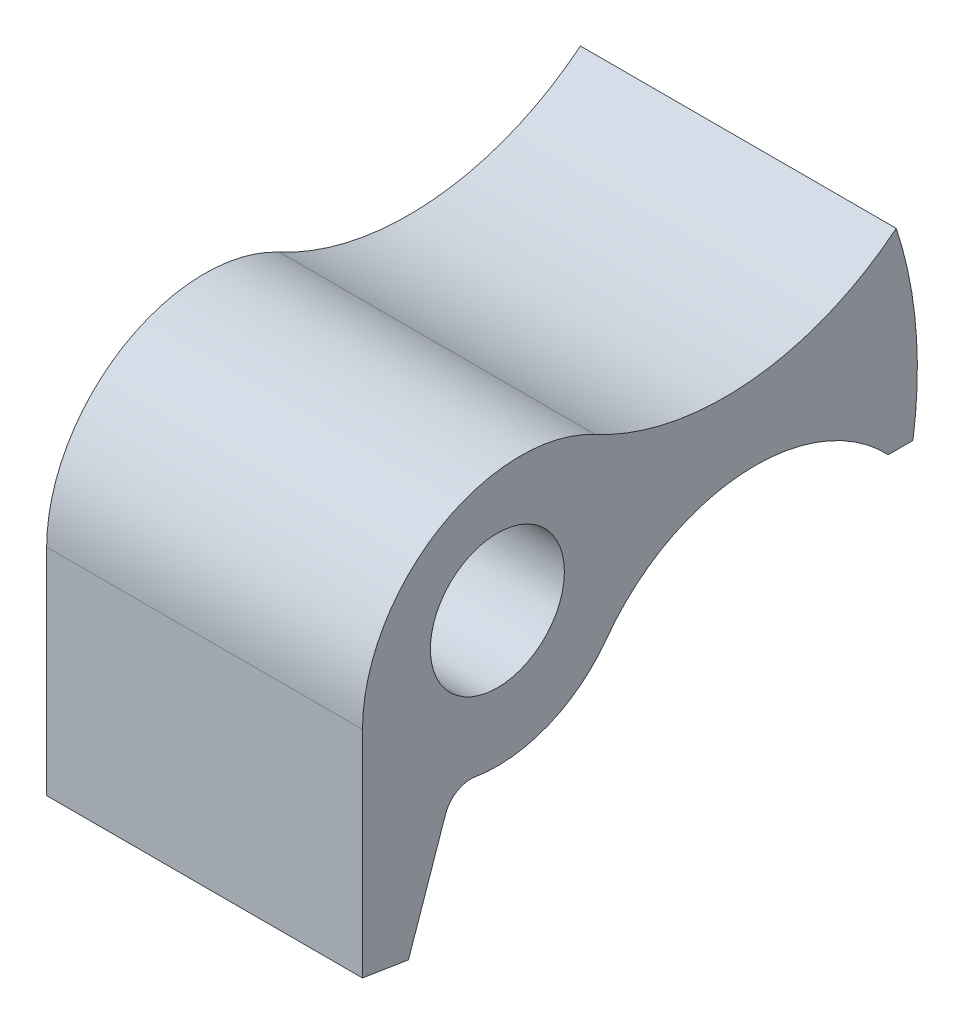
ISO-10303-21;
HEADER;
FILE_DESCRIPTION(('STEP AP214'),'2;1');
FILE_NAME('part.step','',(''),(''),'','','');
FILE_SCHEMA(('AUTOMOTIVE_DESIGN { 1 0 10303 214 1 1 1 1 }'));
ENDSEC;
DATA;
#1=APPLICATION_CONTEXT('core data for automotive mechanical design processes');
#2=APPLICATION_PROTOCOL_DEFINITION('international standard','automotive_design',2000,#1);
#3=PRODUCT_CONTEXT('',#1,'mechanical');
#4=PRODUCT('Part','Part','',(#3));
#5=PRODUCT_RELATED_PRODUCT_CATEGORY('part','',(#4));
#6=PRODUCT_DEFINITION_FORMATION('','',#4);
#7=PRODUCT_DEFINITION_CONTEXT('part definition',#1,'design');
#8=PRODUCT_DEFINITION('design','',#6,#7);
#9=PRODUCT_DEFINITION_SHAPE('','',#8);
#10=(LENGTH_UNIT() NAMED_UNIT(*) SI_UNIT(.MILLI.,.METRE.));
#11=(NAMED_UNIT(*) PLANE_ANGLE_UNIT() SI_UNIT($,.RADIAN.));
#12=(NAMED_UNIT(*) SI_UNIT($,.STERADIAN.) SOLID_ANGLE_UNIT());
#13=UNCERTAINTY_MEASURE_WITH_UNIT(LENGTH_MEASURE(1.E-05),#10,'distance_accuracy_value','');
#14=(GEOMETRIC_REPRESENTATION_CONTEXT(3) GLOBAL_UNCERTAINTY_ASSIGNED_CONTEXT((#13)) GLOBAL_UNIT_ASSIGNED_CONTEXT((#10,
#11,#12)) REPRESENTATION_CONTEXT('',''));
#15=CARTESIAN_POINT('',(0.,0.,0.));
#16=DIRECTION('',(0.,0.,1.));
#17=DIRECTION('',(1.,0.,0.));
#18=AXIS2_PLACEMENT_3D('',#15,#16,#17);
#19=CARTESIAN_POINT('',(4.699,-1.05949246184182,-0.6858));
#20=DIRECTION('',(-1.,0.,0.));
#21=DIRECTION('',(0.,0.,1.));
#22=AXIS2_PLACEMENT_3D('',#19,#20,#21);
#23=PLANE('',#22);
#24=CARTESIAN_POINT('',(4.699,-1.05949246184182,-0.6858));
#25=DIRECTION('',(1.,0.,0.));
#26=DIRECTION('',(0.,0.,1.));
#27=AXIS2_PLACEMENT_3D('',#24,#25,#26);
#28=CIRCLE('',#27,4.699);
#29=CARTESIAN_POINT('',(4.699,3.07853348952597,-2.91230897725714));
#30=VERTEX_POINT('',#29);
#31=CARTESIAN_POINT('',(4.699,-1.05949246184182,4.0132));
#32=VERTEX_POINT('',#31);
#33=EDGE_CURVE('E168',#30,#32,#28,.T.);
#34=ORIENTED_EDGE('',*,*,#33,.T.);
#35=DIRECTION('',(0.,-1.,0.));
#36=VECTOR('',#35,1.);
#37=CARTESIAN_POINT('',(4.699,-1.05949246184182,4.0132));
#38=LINE('',#37,#36);
#39=CARTESIAN_POINT('',(4.699,-7.4651050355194,4.0132));
#40=VERTEX_POINT('',#39);
#41=EDGE_CURVE('E106',#32,#40,#38,.T.);
#42=ORIENTED_EDGE('',*,*,#41,.T.);
#43=DIRECTION('',(0.,-0.156434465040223,-0.987688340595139));
#44=VECTOR('',#43,1.);
#45=CARTESIAN_POINT('',(4.699,-7.4651050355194,4.0132));
#46=LINE('',#45,#44);
#47=CARTESIAN_POINT('',(4.699,-7.68179789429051,2.64505513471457));
#48=VERTEX_POINT('',#47);
#49=EDGE_CURVE('E190',#40,#48,#46,.T.);
#50=ORIENTED_EDGE('',*,*,#49,.T.);
#51=DIRECTION('',(0.,0.945518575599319,-0.32556815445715));
#52=VECTOR('',#51,1.);
#53=CARTESIAN_POINT('',(4.699,-7.68179789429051,2.64505513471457));
#54=LINE('',#53,#52);
#55=CARTESIAN_POINT('',(4.699,-4.4826684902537,1.54350654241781));
#56=VERTEX_POINT('',#55);
#57=EDGE_CURVE('E209',#48,#56,#54,.T.);
#58=ORIENTED_EDGE('',*,*,#57,.T.);
#59=CARTESIAN_POINT('',(4.699,-4.74108821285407,0.793001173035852));
#60=DIRECTION('',(-1.,0.,0.));
#61=DIRECTION('',(0.,0.,1.));
#62=AXIS2_PLACEMENT_3D('',#59,#60,#61);
#63=CIRCLE('',#62,0.79375);
#64=CARTESIAN_POINT('',(4.699,-3.95821367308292,0.662056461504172));
#65=VERTEX_POINT('',#64);
#66=EDGE_CURVE('E206',#56,#65,#63,.T.);
#67=ORIENTED_EDGE('',*,*,#66,.T.);
#68=CARTESIAN_POINT('',(4.699,0.,0.));
#69=DIRECTION('',(1.,0.,0.));
#70=DIRECTION('',(0.,0.,-1.));
#71=AXIS2_PLACEMENT_3D('',#68,#69,#70);
#72=CIRCLE('',#71,4.0132);
#73=CARTESIAN_POINT('',(4.699,-2.35627560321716,-3.24865195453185));
#74=VERTEX_POINT('',#73);
#75=EDGE_CURVE('E208',#65,#74,#72,.T.);
#76=ORIENTED_EDGE('',*,*,#75,.T.);
#77=CARTESIAN_POINT('',(4.699,-5.5626,-7.66928594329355));
#78=DIRECTION('',(-1.,0.,0.));
#79=DIRECTION('',(0.,0.,-1.));
#80=AXIS2_PLACEMENT_3D('',#77,#78,#79);
#81=CIRCLE('',#80,5.461);
#82=CARTESIAN_POINT('',(4.699,-1.8034,-11.6304646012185));
#83=VERTEX_POINT('',#82);
#84=EDGE_CURVE('E131',#74,#83,#81,.T.);
#85=ORIENTED_EDGE('',*,*,#84,.T.);
#86=DIRECTION('',(0.,0.,-1.));
#87=VECTOR('',#86,1.);
#88=CARTESIAN_POINT('',(4.699,-1.8034,-11.6304646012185));
#89=LINE('',#88,#87);
#90=CARTESIAN_POINT('',(4.699,-1.8034,-12.3659920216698));
#91=VERTEX_POINT('',#90);
#92=EDGE_CURVE('E125',#83,#91,#89,.T.);
#93=ORIENTED_EDGE('',*,*,#92,.T.);
#94=CARTESIAN_POINT('',(4.699,0.,0.));
#95=DIRECTION('',(1.,0.,0.));
#96=DIRECTION('',(0.,0.,-1.));
#97=AXIS2_PLACEMENT_3D('',#94,#95,#96);
#98=CIRCLE('',#97,12.4968);
#99=CARTESIAN_POINT('',(4.699,3.9116,-11.8688413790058));
#100=VERTEX_POINT('',#99);
#101=EDGE_CURVE('E129',#91,#100,#98,.T.);
#102=ORIENTED_EDGE('',*,*,#101,.T.);
#103=CARTESIAN_POINT('',(4.699,10.2362,-6.76356774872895));
#104=DIRECTION('',(-1.,0.,0.));
#105=DIRECTION('',(0.,0.,1.));
#106=AXIS2_PLACEMENT_3D('',#103,#104,#105);
#107=CIRCLE('',#106,8.128);
#108=EDGE_CURVE('E57',#100,#30,#107,.T.);
#109=ORIENTED_EDGE('',*,*,#108,.T.);
#110=EDGE_LOOP('',(#34,#42,#50,#58,#67,#76,#85,#93,#102,#109));
#111=FACE_BOUND('',#110,.T.);
#112=CARTESIAN_POINT('',(4.699,0.,0.));
#113=DIRECTION('',(1.,0.,0.));
#114=DIRECTION('',(0.,0.,-1.));
#115=AXIS2_PLACEMENT_3D('',#112,#113,#114);
#116=CIRCLE('',#115,1.9939);
#117=CARTESIAN_POINT('',(4.699,0.,-1.9939));
#118=VERTEX_POINT('',#117);
#119=EDGE_CURVE('E153',#118,#118,#116,.T.);
#120=ORIENTED_EDGE('',*,*,#119,.F.);
#121=EDGE_LOOP('',(#120));
#122=FACE_BOUND('',#121,.T.);
#123=ADVANCED_FACE('F35',(#111,#122),#23,.F.);
#124=CARTESIAN_POINT('',(-4.699,-1.05949246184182,-0.6858));
#125=DIRECTION('',(-1.,0.,0.));
#126=DIRECTION('',(0.,0.,1.));
#127=AXIS2_PLACEMENT_3D('',#124,#125,#126);
#128=PLANE('',#127);
#129=CARTESIAN_POINT('',(-4.699,-1.05949246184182,-0.6858));
#130=DIRECTION('',(1.,0.,0.));
#131=DIRECTION('',(0.,0.,1.));
#132=AXIS2_PLACEMENT_3D('',#129,#130,#131);
#133=CIRCLE('',#132,4.699);
#134=CARTESIAN_POINT('',(-4.699,3.07853348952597,-2.91230897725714));
#135=VERTEX_POINT('',#134);
#136=CARTESIAN_POINT('',(-4.699,-1.05949246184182,4.0132));
#137=VERTEX_POINT('',#136);
#138=EDGE_CURVE('E149',#135,#137,#133,.T.);
#139=ORIENTED_EDGE('',*,*,#138,.F.);
#140=CARTESIAN_POINT('',(-4.699,10.2362,-6.76356774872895));
#141=DIRECTION('',(-1.,0.,0.));
#142=DIRECTION('',(0.,0.,1.));
#143=AXIS2_PLACEMENT_3D('',#140,#141,#142);
#144=CIRCLE('',#143,8.128);
#145=CARTESIAN_POINT('',(-4.699,3.9116,-11.8688413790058));
#146=VERTEX_POINT('',#145);
#147=EDGE_CURVE('E98',#146,#135,#144,.T.);
#148=ORIENTED_EDGE('',*,*,#147,.F.);
#149=CARTESIAN_POINT('',(-4.699,0.,0.));
#150=DIRECTION('',(1.,0.,0.));
#151=DIRECTION('',(0.,0.,-1.));
#152=AXIS2_PLACEMENT_3D('',#149,#150,#151);
#153=CIRCLE('',#152,12.4968);
#154=CARTESIAN_POINT('',(-4.699,-1.8034,-12.3659920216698));
#155=VERTEX_POINT('',#154);
#156=EDGE_CURVE('E92',#155,#146,#153,.T.);
#157=ORIENTED_EDGE('',*,*,#156,.F.);
#158=DIRECTION('',(0.,0.,-1.));
#159=VECTOR('',#158,1.);
#160=CARTESIAN_POINT('',(-4.699,-1.8034,-11.6304646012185));
#161=LINE('',#160,#159);
#162=CARTESIAN_POINT('',(-4.699,-1.8034,-11.6304646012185));
#163=VERTEX_POINT('',#162);
#164=EDGE_CURVE('E139',#163,#155,#161,.T.);
#165=ORIENTED_EDGE('',*,*,#164,.F.);
#166=CARTESIAN_POINT('',(-4.699,-5.5626,-7.66928594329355));
#167=DIRECTION('',(-1.,0.,0.));
#168=DIRECTION('',(0.,0.,-1.));
#169=AXIS2_PLACEMENT_3D('',#166,#167,#168);
#170=CIRCLE('',#169,5.461);
#171=CARTESIAN_POINT('',(-4.699,-2.35627560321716,-3.24865195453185));
#172=VERTEX_POINT('',#171);
#173=EDGE_CURVE('E163',#172,#163,#170,.T.);
#174=ORIENTED_EDGE('',*,*,#173,.F.);
#175=CARTESIAN_POINT('',(-4.699,0.,0.));
#176=DIRECTION('',(1.,0.,0.));
#177=DIRECTION('',(0.,0.,-1.));
#178=AXIS2_PLACEMENT_3D('',#175,#176,#177);
#179=CIRCLE('',#178,4.0132);
#180=CARTESIAN_POINT('',(-4.699,-3.95821367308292,0.662056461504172));
#181=VERTEX_POINT('',#180);
#182=EDGE_CURVE('E161',#181,#172,#179,.T.);
#183=ORIENTED_EDGE('',*,*,#182,.F.);
#184=CARTESIAN_POINT('',(-4.699,-4.74108821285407,0.793001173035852));
#185=DIRECTION('',(-1.,0.,0.));
#186=DIRECTION('',(0.,0.,1.));
#187=AXIS2_PLACEMENT_3D('',#184,#185,#186);
#188=CIRCLE('',#187,0.79375);
#189=CARTESIAN_POINT('',(-4.699,-4.4826684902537,1.54350654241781));
#190=VERTEX_POINT('',#189);
#191=EDGE_CURVE('E159',#190,#181,#188,.T.);
#192=ORIENTED_EDGE('',*,*,#191,.F.);
#193=DIRECTION('',(0.,0.945518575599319,-0.32556815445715));
#194=VECTOR('',#193,1.);
#195=CARTESIAN_POINT('',(-4.699,-7.68179789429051,2.64505513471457));
#196=LINE('',#195,#194);
#197=CARTESIAN_POINT('',(-4.699,-7.68179789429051,2.64505513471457));
#198=VERTEX_POINT('',#197);
#199=EDGE_CURVE('E157',#198,#190,#196,.T.);
#200=ORIENTED_EDGE('',*,*,#199,.F.);
#201=DIRECTION('',(0.,-0.156434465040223,-0.987688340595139));
#202=VECTOR('',#201,1.);
#203=CARTESIAN_POINT('',(-4.699,-7.4651050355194,4.0132));
#204=LINE('',#203,#202);
#205=CARTESIAN_POINT('',(-4.699,-7.4651050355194,4.0132));
#206=VERTEX_POINT('',#205);
#207=EDGE_CURVE('E155',#206,#198,#204,.T.);
#208=ORIENTED_EDGE('',*,*,#207,.F.);
#209=DIRECTION('',(0.,-1.,0.));
#210=VECTOR('',#209,1.);
#211=CARTESIAN_POINT('',(-4.699,-1.05949246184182,4.0132));
#212=LINE('',#211,#210);
#213=EDGE_CURVE('E152',#137,#206,#212,.T.);
#214=ORIENTED_EDGE('',*,*,#213,.F.);
#215=EDGE_LOOP('',(#139,#148,#157,#165,#174,#183,#192,#200,#208,#214));
#216=FACE_BOUND('',#215,.T.);
#217=CARTESIAN_POINT('',(-4.699,0.,0.));
#218=DIRECTION('',(1.,0.,0.));
#219=DIRECTION('',(0.,0.,-1.));
#220=AXIS2_PLACEMENT_3D('',#217,#218,#219);
#221=CIRCLE('',#220,1.9939);
#222=CARTESIAN_POINT('',(-4.699,0.,-1.9939));
#223=VERTEX_POINT('',#222);
#224=EDGE_CURVE('E217',#223,#223,#221,.T.);
#225=ORIENTED_EDGE('',*,*,#224,.T.);
#226=EDGE_LOOP('',(#225));
#227=FACE_BOUND('',#226,.T.);
#228=ADVANCED_FACE('F194',(#216,#227),#128,.T.);
#229=CARTESIAN_POINT('',(4.699,-1.05949246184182,-0.6858));
#230=DIRECTION('',(-1.,0.,0.));
#231=DIRECTION('',(0.,0.,1.));
#232=AXIS2_PLACEMENT_3D('',#229,#230,#231);
#233=CYLINDRICAL_SURFACE('',#232,4.699);
#234=ORIENTED_EDGE('',*,*,#138,.T.);
#235=DIRECTION('',(-1.,0.,0.));
#236=VECTOR('',#235,1.);
#237=CARTESIAN_POINT('',(4.699,-1.05949246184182,4.0132));
#238=LINE('',#237,#236);
#239=EDGE_CURVE('E11',#32,#137,#238,.T.);
#240=ORIENTED_EDGE('',*,*,#239,.F.);
#241=ORIENTED_EDGE('',*,*,#33,.F.);
#242=DIRECTION('',(-1.,0.,0.));
#243=VECTOR('',#242,1.);
#244=CARTESIAN_POINT('',(4.699,3.07853348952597,-2.91230897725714));
#245=LINE('',#244,#243);
#246=EDGE_CURVE('E145',#30,#135,#245,.T.);
#247=ORIENTED_EDGE('',*,*,#246,.T.);
#248=EDGE_LOOP('',(#234,#240,#241,#247));
#249=FACE_BOUND('',#248,.T.);
#250=ADVANCED_FACE('F37',(#249),#233,.T.);
#251=CARTESIAN_POINT('',(4.699,-1.05949246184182,4.0132));
#252=DIRECTION('',(0.,0.,-1.));
#253=DIRECTION('',(0.,1.,0.));
#254=AXIS2_PLACEMENT_3D('',#251,#252,#253);
#255=PLANE('',#254);
#256=ORIENTED_EDGE('',*,*,#213,.T.);
#257=DIRECTION('',(-1.,0.,0.));
#258=VECTOR('',#257,1.);
#259=CARTESIAN_POINT('',(4.699,-7.4651050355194,4.0132));
#260=LINE('',#259,#258);
#261=EDGE_CURVE('E49',#40,#206,#260,.T.);
#262=ORIENTED_EDGE('',*,*,#261,.F.);
#263=ORIENTED_EDGE('',*,*,#41,.F.);
#264=ORIENTED_EDGE('',*,*,#239,.T.);
#265=EDGE_LOOP('',(#256,#262,#263,#264));
#266=FACE_BOUND('',#265,.T.);
#267=ADVANCED_FACE('F270',(#266),#255,.F.);
#268=CARTESIAN_POINT('',(4.699,-7.4651050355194,4.0132));
#269=DIRECTION('',(0.,0.987688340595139,-0.156434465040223));
#270=DIRECTION('',(0.,0.156434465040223,0.987688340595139));
#271=AXIS2_PLACEMENT_3D('',#268,#269,#270);
#272=PLANE('',#271);
#273=ORIENTED_EDGE('',*,*,#207,.T.);
#274=DIRECTION('',(-1.,0.,0.));
#275=VECTOR('',#274,1.);
#276=CARTESIAN_POINT('',(4.699,-7.68179789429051,2.64505513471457));
#277=LINE('',#276,#275);
#278=EDGE_CURVE('E181',#48,#198,#277,.T.);
#279=ORIENTED_EDGE('',*,*,#278,.F.);
#280=ORIENTED_EDGE('',*,*,#49,.F.);
#281=ORIENTED_EDGE('',*,*,#261,.T.);
#282=EDGE_LOOP('',(#273,#279,#280,#281));
#283=FACE_BOUND('',#282,.T.);
#284=ADVANCED_FACE('F188',(#283),#272,.F.);
#285=CARTESIAN_POINT('',(4.699,-7.68179789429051,2.64505513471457));
#286=DIRECTION('',(0.,0.32556815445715,0.945518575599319));
#287=DIRECTION('',(0.,-0.945518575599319,0.32556815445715));
#288=AXIS2_PLACEMENT_3D('',#285,#286,#287);
#289=PLANE('',#288);
#290=ORIENTED_EDGE('',*,*,#199,.T.);
#291=DIRECTION('',(-1.,0.,0.));
#292=VECTOR('',#291,1.);
#293=CARTESIAN_POINT('',(4.699,-4.4826684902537,1.54350654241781));
#294=LINE('',#293,#292);
#295=EDGE_CURVE('E178',#56,#190,#294,.T.);
#296=ORIENTED_EDGE('',*,*,#295,.F.);
#297=ORIENTED_EDGE('',*,*,#57,.F.);
#298=ORIENTED_EDGE('',*,*,#278,.T.);
#299=EDGE_LOOP('',(#290,#296,#297,#298));
#300=FACE_BOUND('',#299,.T.);
#301=ADVANCED_FACE('F200',(#300),#289,.F.);
#302=CARTESIAN_POINT('',(4.699,-4.74108821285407,0.793001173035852));
#303=DIRECTION('',(-1.,0.,0.));
#304=DIRECTION('',(0.,0.,1.));
#305=AXIS2_PLACEMENT_3D('',#302,#303,#304);
#306=CYLINDRICAL_SURFACE('',#305,0.79375);
#307=ORIENTED_EDGE('',*,*,#191,.T.);
#308=DIRECTION('',(-1.,0.,0.));
#309=VECTOR('',#308,1.);
#310=CARTESIAN_POINT('',(4.699,-3.95821367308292,0.662056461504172));
#311=LINE('',#310,#309);
#312=EDGE_CURVE('E175',#65,#181,#311,.T.);
#313=ORIENTED_EDGE('',*,*,#312,.F.);
#314=ORIENTED_EDGE('',*,*,#66,.F.);
#315=ORIENTED_EDGE('',*,*,#295,.T.);
#316=EDGE_LOOP('',(#307,#313,#314,#315));
#317=FACE_BOUND('',#316,.T.);
#318=ADVANCED_FACE('F204',(#317),#306,.F.);
#319=CARTESIAN_POINT('',(4.699,0.,0.));
#320=DIRECTION('',(-1.,0.,0.));
#321=DIRECTION('',(0.,0.,1.));
#322=AXIS2_PLACEMENT_3D('',#319,#320,#321);
#323=CYLINDRICAL_SURFACE('',#322,4.0132);
#324=ORIENTED_EDGE('',*,*,#182,.T.);
#325=DIRECTION('',(-1.,0.,0.));
#326=VECTOR('',#325,1.);
#327=CARTESIAN_POINT('',(4.699,-2.35627560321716,-3.24865195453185));
#328=LINE('',#327,#326);
#329=EDGE_CURVE('E172',#74,#172,#328,.T.);
#330=ORIENTED_EDGE('',*,*,#329,.F.);
#331=ORIENTED_EDGE('',*,*,#75,.F.);
#332=ORIENTED_EDGE('',*,*,#312,.T.);
#333=EDGE_LOOP('',(#324,#330,#331,#332));
#334=FACE_BOUND('',#333,.T.);
#335=ADVANCED_FACE('F261',(#334),#323,.T.);
#336=CARTESIAN_POINT('',(4.699,-5.5626,-7.66928594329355));
#337=DIRECTION('',(-1.,0.,0.));
#338=DIRECTION('',(0.,0.,1.));
#339=AXIS2_PLACEMENT_3D('',#336,#337,#338);
#340=CYLINDRICAL_SURFACE('',#339,5.461);
#341=CARTESIAN_POINT('',(0.,-0.58852194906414,-9.92340850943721));
#342=CARTESIAN_POINT('',(-0.113006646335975,-0.588525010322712,-9.92341106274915));
#343=CARTESIAN_POINT('',(-0.225990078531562,-0.584474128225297,-9.91453844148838));
#344=CARTESIAN_POINT('',(-0.448634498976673,-0.568741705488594,-9.87932421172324));
#345=CARTESIAN_POINT('',(-0.558295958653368,-0.557061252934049,-9.85298509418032));
#346=CARTESIAN_POINT('',(-0.771117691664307,-0.527368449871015,-9.78361144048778));
#347=CARTESIAN_POINT('',(-0.874285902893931,-0.5093640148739,-9.74059776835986));
#348=CARTESIAN_POINT('',(-1.0716432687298,-0.468869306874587,-9.63890856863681));
#349=CARTESIAN_POINT('',(-1.16583029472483,-0.446377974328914,-9.58022934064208));
#350=CARTESIAN_POINT('',(-1.34494695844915,-0.398530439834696,-9.44693184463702));
#351=CARTESIAN_POINT('',(-1.42960929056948,-0.373119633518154,-9.37197359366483));
#352=CARTESIAN_POINT('',(-1.584810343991,-0.322340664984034,-9.20860596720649));
#353=CARTESIAN_POINT('',(-1.65534923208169,-0.29697250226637,-9.12019675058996));
#354=CARTESIAN_POINT('',(-1.78031849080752,-0.248668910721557,-8.93186441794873));
#355=CARTESIAN_POINT('',(-1.8347301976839,-0.225736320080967,-8.83192814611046));
#356=CARTESIAN_POINT('',(-1.9255544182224,-0.184529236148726,-8.62330712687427));
#357=CARTESIAN_POINT('',(-1.96197360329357,-0.166253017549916,-8.51462563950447));
#358=CARTESIAN_POINT('',(-2.01446416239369,-0.136697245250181,-8.29670520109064));
#359=CARTESIAN_POINT('',(-2.0313609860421,-0.12514501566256,-8.18770157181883));
#360=CARTESIAN_POINT('',(-2.04730568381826,-0.108658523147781,-7.96791812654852));
#361=CARTESIAN_POINT('',(-2.04635551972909,-0.103723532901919,-7.85713850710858));
#362=CARTESIAN_POINT('',(-2.02719531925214,-0.100615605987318,-7.63918679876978));
#363=CARTESIAN_POINT('',(-2.0093200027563,-0.102313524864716,-7.53198639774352));
#364=CARTESIAN_POINT('',(-1.95772197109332,-0.111652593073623,-7.32175647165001));
#365=CARTESIAN_POINT('',(-1.92399611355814,-0.119294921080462,-7.21872777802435));
#366=CARTESIAN_POINT('',(-1.83992534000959,-0.139994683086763,-7.0143581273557));
#367=CARTESIAN_POINT('',(-1.78885281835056,-0.153297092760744,-6.91334217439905));
#368=CARTESIAN_POINT('',(-1.67212583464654,-0.183725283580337,-6.7207334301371));
#369=CARTESIAN_POINT('',(-1.60646441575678,-0.20085288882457,-6.62914516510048));
#370=CARTESIAN_POINT('',(-1.45662717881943,-0.238391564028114,-6.45100239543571));
#371=CARTESIAN_POINT('',(-1.37143741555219,-0.258952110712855,-6.36532923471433));
#372=CARTESIAN_POINT('',(-1.18765647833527,-0.299681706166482,-6.20959232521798));
#373=CARTESIAN_POINT('',(-1.0890617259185,-0.319850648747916,-6.13953275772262));
#374=CARTESIAN_POINT('',(-0.880398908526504,-0.356990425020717,-6.01754894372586));
#375=CARTESIAN_POINT('',(-0.770314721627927,-0.373956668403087,-5.96565063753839));
#376=CARTESIAN_POINT('',(-0.541820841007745,-0.40186059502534,-5.88288387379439));
#377=CARTESIAN_POINT('',(-0.423421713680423,-0.412805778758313,-5.85198924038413));
#378=CARTESIAN_POINT('',(-0.195426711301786,-0.42589931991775,-5.81532777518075));
#379=CARTESIAN_POINT('',(-0.0862538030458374,-0.428867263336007,-5.80721554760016));
#380=CARTESIAN_POINT('',(0.131821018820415,-0.427917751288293,-5.80983276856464));
#381=CARTESIAN_POINT('',(0.240723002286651,-0.424002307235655,-5.82055671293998));
#382=CARTESIAN_POINT('',(0.446926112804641,-0.410441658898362,-5.85872152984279));
#383=CARTESIAN_POINT('',(0.544496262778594,-0.401231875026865,-5.88489570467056));
#384=CARTESIAN_POINT('',(0.73404963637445,-0.378639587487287,-5.95163942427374));
#385=CARTESIAN_POINT('',(0.826031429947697,-0.365256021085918,-5.99221263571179));
#386=CARTESIAN_POINT('',(1.00845593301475,-0.334875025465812,-6.08936209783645));
#387=CARTESIAN_POINT('',(1.09839991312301,-0.317697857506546,-6.14681506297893));
#388=CARTESIAN_POINT('',(1.26841073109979,-0.282287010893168,-6.27457831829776));
#389=CARTESIAN_POINT('',(1.34847249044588,-0.264052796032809,-6.34489517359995));
#390=CARTESIAN_POINT('',(1.50583994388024,-0.226393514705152,-6.50526911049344));
#391=CARTESIAN_POINT('',(1.58181680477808,-0.207066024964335,-6.59665805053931));
#392=CARTESIAN_POINT('',(1.71825061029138,-0.171786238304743,-6.79099243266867));
#393=CARTESIAN_POINT('',(1.77870295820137,-0.155834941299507,-6.89394128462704));
#394=CARTESIAN_POINT('',(1.88384764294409,-0.128956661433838,-7.11209954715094));
#395=CARTESIAN_POINT('',(1.92801958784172,-0.118192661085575,-7.22758196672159));
#396=CARTESIAN_POINT('',(1.99608338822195,-0.104139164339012,-7.46480913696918));
#397=CARTESIAN_POINT('',(2.01998651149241,-0.100845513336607,-7.58655036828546));
#398=CARTESIAN_POINT('',(2.04520229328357,-0.102589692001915,-7.82414991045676));
#399=CARTESIAN_POINT('',(2.04790527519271,-0.10709057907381,-7.93986436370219));
#400=CARTESIAN_POINT('',(2.03384852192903,-0.123347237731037,-8.16957779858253));
#401=CARTESIAN_POINT('',(2.01709558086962,-0.135100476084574,-8.28357736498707));
#402=CARTESIAN_POINT('',(1.96603784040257,-0.164064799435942,-8.49967308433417));
#403=CARTESIAN_POINT('',(1.93281505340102,-0.180917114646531,-8.60207560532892));
#404=CARTESIAN_POINT('',(1.85040441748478,-0.21886578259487,-8.79938551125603));
#405=CARTESIAN_POINT('',(1.80121553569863,-0.239962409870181,-8.894292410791));
#406=CARTESIAN_POINT('',(1.68757551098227,-0.284910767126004,-9.07546873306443));
#407=CARTESIAN_POINT('',(1.6229406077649,-0.308793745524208,-9.1616148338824));
#408=CARTESIAN_POINT('',(1.4804869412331,-0.357036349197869,-9.3220588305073));
#409=CARTESIAN_POINT('',(1.40266525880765,-0.381396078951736,-9.39635409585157));
#410=CARTESIAN_POINT('',(1.23194219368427,-0.429530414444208,-9.53469013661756));
#411=CARTESIAN_POINT('',(1.13851638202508,-0.45322817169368,-9.59811177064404));
#412=CARTESIAN_POINT('',(0.941720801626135,-0.49647029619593,-9.70899291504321));
#413=CARTESIAN_POINT('',(0.838348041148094,-0.516013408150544,-9.75644760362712));
#414=CARTESIAN_POINT('',(0.615228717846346,-0.550281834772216,-9.83753683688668));
#415=CARTESIAN_POINT('',(0.494837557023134,-0.564454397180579,-9.8696483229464));
#416=CARTESIAN_POINT('',(0.249620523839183,-0.583571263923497,-9.91257928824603));
#417=CARTESIAN_POINT('',(0.124796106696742,-0.588518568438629,-9.92340568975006));
#418=CARTESIAN_POINT('',(0.,-0.58852194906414,-9.92340850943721));
#419=B_SPLINE_CURVE_WITH_KNOTS('',3,(#341,#342,#343,#344,#345,#346,#347,#348,#349,#350,#351,
#352,#353,#354,#355,#356,#357,#358,#359,#360,#361,#362,#363,#364,#365,#366,#367,#368,#369,#370,
#371,#372,#373,#374,#375,#376,#377,#378,#379,#380,#381,#382,#383,#384,#385,#386,#387,#388,#389,
#390,#391,#392,#393,#394,#395,#396,#397,#398,#399,#400,#401,#402,#403,#404,#405,#406,#407,#408,
#409,#410,#411,#412,#413,#414,#415,#416,#417,#418),.UNSPECIFIED.,.T.,.F.,(4,2,2,2,2,2,2,2,2,2,2,
2,2,2,2,2,2,2,2,2,2,2,2,2,2,2,2,2,2,2,2,2,2,2,2,2,2,2,4),(0.,0.338567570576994,
0.677086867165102,1.01518395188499,1.35336097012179,1.69942928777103,2.04549351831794,
2.39195669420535,2.73829130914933,3.06937399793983,3.40042029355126,3.7250534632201,
4.04975101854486,4.39021861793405,4.73084892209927,5.09681953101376,5.46288802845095,
5.82947727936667,6.19560882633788,6.52235779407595,6.84901129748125,7.15201187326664,
7.455089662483,7.77809240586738,8.10126045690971,8.46087031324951,8.82058652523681,
9.19096762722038,9.56114269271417,9.90682000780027,10.2523766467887,10.5777554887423,
10.9031553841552,11.2326382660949,11.5621941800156,11.9067207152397,12.2513511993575,
12.6253616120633,12.9992503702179),.UNSPECIFIED.);
#420=CARTESIAN_POINT('',(0.,-0.58852194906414,-9.92340850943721));
#421=VERTEX_POINT('',#420);
#422=EDGE_CURVE('E39',#421,#421,#419,.T.);
#423=ORIENTED_EDGE('',*,*,#422,.T.);
#424=EDGE_LOOP('',(#423));
#425=FACE_BOUND('',#424,.T.);
#426=ORIENTED_EDGE('',*,*,#173,.T.);
#427=DIRECTION('',(-1.,0.,0.));
#428=VECTOR('',#427,1.);
#429=CARTESIAN_POINT('',(4.699,-1.8034,-11.6304646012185));
#430=LINE('',#429,#428);
#431=EDGE_CURVE('E140',#83,#163,#430,.T.);
#432=ORIENTED_EDGE('',*,*,#431,.F.);
#433=ORIENTED_EDGE('',*,*,#84,.F.);
#434=ORIENTED_EDGE('',*,*,#329,.T.);
#435=EDGE_LOOP('',(#426,#432,#433,#434));
#436=FACE_BOUND('',#435,.T.);
#437=ADVANCED_FACE('F229',(#425,#436),#340,.F.);
#438=CARTESIAN_POINT('',(4.699,-1.8034,-11.6304646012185));
#439=DIRECTION('',(0.,1.,0.));
#440=DIRECTION('',(0.,0.,1.));
#441=AXIS2_PLACEMENT_3D('',#438,#439,#440);
#442=PLANE('',#441);
#443=ORIENTED_EDGE('',*,*,#164,.T.);
#444=DIRECTION('',(-1.,0.,0.));
#445=VECTOR('',#444,1.);
#446=CARTESIAN_POINT('',(4.699,-1.8034,-12.3659920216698));
#447=LINE('',#446,#445);
#448=EDGE_CURVE('E136',#91,#155,#447,.T.);
#449=ORIENTED_EDGE('',*,*,#448,.F.);
#450=ORIENTED_EDGE('',*,*,#92,.F.);
#451=ORIENTED_EDGE('',*,*,#431,.T.);
#452=EDGE_LOOP('',(#443,#449,#450,#451));
#453=FACE_BOUND('',#452,.T.);
#454=ADVANCED_FACE('F137',(#453),#442,.F.);
#455=CARTESIAN_POINT('',(4.699,0.,0.));
#456=DIRECTION('',(-1.,0.,0.));
#457=DIRECTION('',(0.,0.,1.));
#458=AXIS2_PLACEMENT_3D('',#455,#456,#457);
#459=CYLINDRICAL_SURFACE('',#458,12.4968);
#460=ORIENTED_EDGE('',*,*,#156,.T.);
#461=DIRECTION('',(-1.,0.,0.));
#462=VECTOR('',#461,1.);
#463=CARTESIAN_POINT('',(4.699,3.9116,-11.8688413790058));
#464=LINE('',#463,#462);
#465=EDGE_CURVE('E141',#100,#146,#464,.T.);
#466=ORIENTED_EDGE('',*,*,#465,.F.);
#467=ORIENTED_EDGE('',*,*,#101,.F.);
#468=ORIENTED_EDGE('',*,*,#448,.T.);
#469=EDGE_LOOP('',(#460,#466,#467,#468));
#470=FACE_BOUND('',#469,.T.);
#471=ADVANCED_FACE('F143',(#470),#459,.T.);
#472=CARTESIAN_POINT('',(4.699,10.2362,-6.76356774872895));
#473=DIRECTION('',(-1.,0.,0.));
#474=DIRECTION('',(0.,0.,1.));
#475=AXIS2_PLACEMENT_3D('',#472,#473,#474);
#476=CYLINDRICAL_SURFACE('',#475,8.128);
#477=ORIENTED_EDGE('',*,*,#147,.T.);
#478=ORIENTED_EDGE('',*,*,#246,.F.);
#479=ORIENTED_EDGE('',*,*,#108,.F.);
#480=ORIENTED_EDGE('',*,*,#465,.T.);
#481=EDGE_LOOP('',(#477,#478,#479,#480));
#482=FACE_BOUND('',#481,.T.);
#483=ADVANCED_FACE('F242',(#482),#476,.F.);
#484=CARTESIAN_POINT('',(4.699,0.,0.));
#485=DIRECTION('',(-1.,0.,0.));
#486=DIRECTION('',(0.,0.,1.));
#487=AXIS2_PLACEMENT_3D('',#484,#485,#486);
#488=CYLINDRICAL_SURFACE('',#487,1.9939);
#489=ORIENTED_EDGE('',*,*,#119,.T.);
#490=EDGE_LOOP('',(#489));
#491=FACE_BOUND('',#490,.T.);
#492=ORIENTED_EDGE('',*,*,#224,.F.);
#493=EDGE_LOOP('',(#492));
#494=FACE_BOUND('',#493,.T.);
#495=ADVANCED_FACE('F235',(#491,#494),#488,.F.);
#496=CARTESIAN_POINT('',(0.,-2.8100869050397,-7.50135974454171));
#497=DIRECTION('',(0.,-0.987688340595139,0.156434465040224));
#498=DIRECTION('',(0.,-0.156434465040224,-0.987688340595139));
#499=AXIS2_PLACEMENT_3D('',#496,#497,#498);
#500=CYLINDRICAL_SURFACE('',#499,2.0447);
#501=CARTESIAN_POINT('',(0.,0.152009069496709,-7.9705096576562));
#502=DIRECTION('',(0.,-0.987688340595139,0.156434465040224));
#503=DIRECTION('',(0.,-0.156434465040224,-0.987688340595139));
#504=AXIS2_PLACEMENT_3D('',#501,#502,#503);
#505=CIRCLE('',#504,2.0447);
#506=CARTESIAN_POINT('',(0.,-0.167852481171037,-9.99003600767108));
#507=VERTEX_POINT('',#506);
#508=EDGE_CURVE('E222',#507,#507,#505,.T.);
#509=ORIENTED_EDGE('',*,*,#508,.F.);
#510=EDGE_LOOP('',(#509));
#511=FACE_BOUND('',#510,.T.);
#512=ORIENTED_EDGE('',*,*,#422,.F.);
#513=EDGE_LOOP('',(#512));
#514=FACE_BOUND('',#513,.T.);
#515=ADVANCED_FACE('F232',(#511,#514),#500,.F.);
#516=CARTESIAN_POINT('',(0.,0.152009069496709,-7.9705096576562));
#517=DIRECTION('',(0.,0.987688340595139,-0.156434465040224));
#518=DIRECTION('',(0.,0.156434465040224,0.987688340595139));
#519=AXIS2_PLACEMENT_3D('',#516,#517,#518);
#520=PLANE('',#519);
#521=ORIENTED_EDGE('',*,*,#508,.T.);
#522=EDGE_LOOP('',(#521));
#523=FACE_BOUND('',#522,.T.);
#524=ADVANCED_FACE('F234',(#523),#520,.F.);
#525=CLOSED_SHELL('',(#123,#228,#250,#267,#284,#301,#318,#335,#437,#454,#471,#483,#495,#515,#524));
#526=MANIFOLD_SOLID_BREP('B2',#525);
#527=ADVANCED_BREP_SHAPE_REPRESENTATION('',(#18,#526),#14);
#528=SHAPE_DEFINITION_REPRESENTATION(#9,#527);
ENDSEC;
END-ISO-10303-21;
